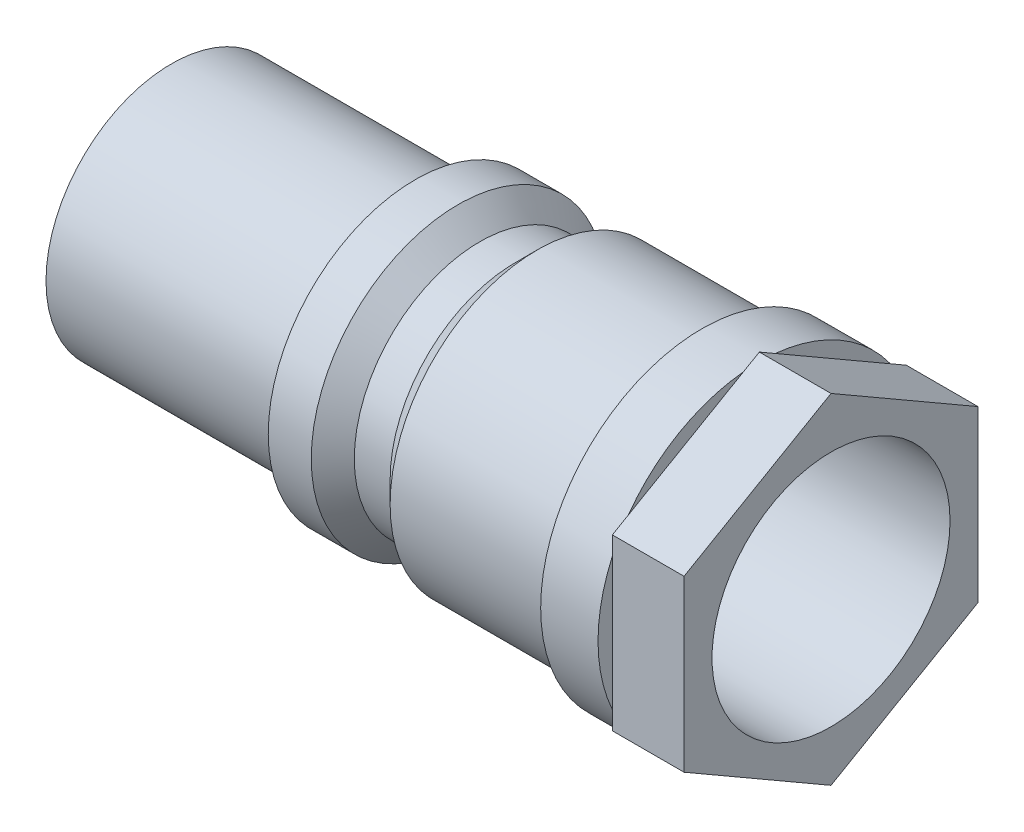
ISO-10303-21;
HEADER;
FILE_DESCRIPTION(('STEP AP214'),'2;1');
FILE_NAME('part.step','',(''),(''),'','','');
FILE_SCHEMA(('AUTOMOTIVE_DESIGN { 1 0 10303 214 1 1 1 1 }'));
ENDSEC;
DATA;
#1=APPLICATION_CONTEXT('core data for automotive mechanical design processes');
#2=APPLICATION_PROTOCOL_DEFINITION('international standard','automotive_design',2000,#1);
#3=PRODUCT_CONTEXT('',#1,'mechanical');
#4=PRODUCT('Part','Part','',(#3));
#5=PRODUCT_RELATED_PRODUCT_CATEGORY('part','',(#4));
#6=PRODUCT_DEFINITION_FORMATION('','',#4);
#7=PRODUCT_DEFINITION_CONTEXT('part definition',#1,'design');
#8=PRODUCT_DEFINITION('design','',#6,#7);
#9=PRODUCT_DEFINITION_SHAPE('','',#8);
#10=(LENGTH_UNIT() NAMED_UNIT(*) SI_UNIT(.MILLI.,.METRE.));
#11=(NAMED_UNIT(*) PLANE_ANGLE_UNIT() SI_UNIT($,.RADIAN.));
#12=(NAMED_UNIT(*) SI_UNIT($,.STERADIAN.) SOLID_ANGLE_UNIT());
#13=UNCERTAINTY_MEASURE_WITH_UNIT(LENGTH_MEASURE(1.E-05),#10,'distance_accuracy_value','');
#14=(GEOMETRIC_REPRESENTATION_CONTEXT(3) GLOBAL_UNCERTAINTY_ASSIGNED_CONTEXT((#13)) GLOBAL_UNIT_ASSIGNED_CONTEXT((#10,
#11,#12)) REPRESENTATION_CONTEXT('',''));
#15=CARTESIAN_POINT('',(0.,0.,0.));
#16=DIRECTION('',(0.,0.,1.));
#17=DIRECTION('',(1.,0.,0.));
#18=AXIS2_PLACEMENT_3D('',#15,#16,#17);
#19=CARTESIAN_POINT('',(82.,22.5,0.));
#20=DIRECTION('',(-1.,0.,0.));
#21=DIRECTION('',(0.,0.,1.));
#22=AXIS2_PLACEMENT_3D('',#19,#20,#21);
#23=PLANE('',#22);
#24=DIRECTION('',(0.,0.5,0.866025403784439));
#25=VECTOR('',#24,1.);
#26=CARTESIAN_POINT('',(82.,11.8356805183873,-20.5));
#27=LINE('',#26,#25);
#28=CARTESIAN_POINT('',(82.,13.1167115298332,-18.2811892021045));
#29=VERTEX_POINT('',#28);
#30=CARTESIAN_POINT('',(82.,22.3903300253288,-2.21881079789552));
#31=VERTEX_POINT('',#30);
#32=EDGE_CURVE('E11',#29,#31,#27,.T.);
#33=ORIENTED_EDGE('',*,*,#32,.F.);
#34=CARTESIAN_POINT('',(82.,0.,0.));
#35=DIRECTION('',(-1.,0.,0.));
#36=DIRECTION('',(0.,0.,1.));
#37=AXIS2_PLACEMENT_3D('',#34,#35,#36);
#38=CIRCLE('',#37,22.5);
#39=EDGE_CURVE('E269',#31,#29,#38,.T.);
#40=ORIENTED_EDGE('',*,*,#39,.F.);
#41=EDGE_LOOP('',(#33,#40));
#42=FACE_BOUND('',#41,.T.);
#43=ADVANCED_FACE('F33',(#42),#23,.F.);
#44=DIRECTION('',(0.,1.,0.));
#45=VECTOR('',#44,1.);
#46=CARTESIAN_POINT('',(82.,-11.8356805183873,-20.5));
#47=LINE('',#46,#45);
#48=CARTESIAN_POINT('',(82.,-9.2736184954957,-20.5));
#49=VERTEX_POINT('',#48);
#50=CARTESIAN_POINT('',(82.,9.27361849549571,-20.5));
#51=VERTEX_POINT('',#50);
#52=EDGE_CURVE('E42',#49,#51,#47,.T.);
#53=ORIENTED_EDGE('',*,*,#52,.F.);
#54=EDGE_CURVE('E273',#51,#49,#38,.T.);
#55=ORIENTED_EDGE('',*,*,#54,.F.);
#56=EDGE_LOOP('',(#53,#55));
#57=FACE_BOUND('',#56,.T.);
#58=ADVANCED_FACE('F238',(#57),#23,.F.);
#59=DIRECTION('',(0.,0.5,-0.866025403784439));
#60=VECTOR('',#59,1.);
#61=CARTESIAN_POINT('',(82.,-23.6713610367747,0.));
#62=LINE('',#61,#60);
#63=CARTESIAN_POINT('',(82.,-22.3903300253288,-2.21881079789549));
#64=VERTEX_POINT('',#63);
#65=CARTESIAN_POINT('',(82.,-13.1167115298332,-18.2811892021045));
#66=VERTEX_POINT('',#65);
#67=EDGE_CURVE('E307',#64,#66,#62,.T.);
#68=ORIENTED_EDGE('',*,*,#67,.F.);
#69=EDGE_CURVE('E279',#66,#64,#38,.T.);
#70=ORIENTED_EDGE('',*,*,#69,.F.);
#71=EDGE_LOOP('',(#68,#70));
#72=FACE_BOUND('',#71,.T.);
#73=ADVANCED_FACE('F245',(#72),#23,.F.);
#74=DIRECTION('',(0.,-0.5,-0.866025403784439));
#75=VECTOR('',#74,1.);
#76=CARTESIAN_POINT('',(82.,-11.8356805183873,20.5));
#77=LINE('',#76,#75);
#78=CARTESIAN_POINT('',(82.,-13.1167115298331,18.2811892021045));
#79=VERTEX_POINT('',#78);
#80=CARTESIAN_POINT('',(82.,-22.3903300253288,2.21881079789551));
#81=VERTEX_POINT('',#80);
#82=EDGE_CURVE('E58',#79,#81,#77,.T.);
#83=ORIENTED_EDGE('',*,*,#82,.F.);
#84=EDGE_CURVE('E285',#81,#79,#38,.T.);
#85=ORIENTED_EDGE('',*,*,#84,.F.);
#86=EDGE_LOOP('',(#83,#85));
#87=FACE_BOUND('',#86,.T.);
#88=ADVANCED_FACE('F257',(#87),#23,.F.);
#89=DIRECTION('',(0.,-1.,0.));
#90=VECTOR('',#89,1.);
#91=CARTESIAN_POINT('',(82.,11.8356805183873,20.5));
#92=LINE('',#91,#90);
#93=CARTESIAN_POINT('',(82.,9.27361849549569,20.5));
#94=VERTEX_POINT('',#93);
#95=CARTESIAN_POINT('',(82.,-9.27361849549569,20.5));
#96=VERTEX_POINT('',#95);
#97=EDGE_CURVE('E190',#94,#96,#92,.T.);
#98=ORIENTED_EDGE('',*,*,#97,.F.);
#99=EDGE_CURVE('E51',#96,#94,#38,.T.);
#100=ORIENTED_EDGE('',*,*,#99,.F.);
#101=EDGE_LOOP('',(#98,#100));
#102=FACE_BOUND('',#101,.T.);
#103=ADVANCED_FACE('F250',(#102),#23,.F.);
#104=DIRECTION('',(0.,-0.5,0.866025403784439));
#105=VECTOR('',#104,1.);
#106=CARTESIAN_POINT('',(82.,23.6713610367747,0.));
#107=LINE('',#106,#105);
#108=CARTESIAN_POINT('',(82.,22.3903300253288,2.21881079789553));
#109=VERTEX_POINT('',#108);
#110=CARTESIAN_POINT('',(82.,13.1167115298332,18.2811892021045));
#111=VERTEX_POINT('',#110);
#112=EDGE_CURVE('E186',#109,#111,#107,.T.);
#113=ORIENTED_EDGE('',*,*,#112,.F.);
#114=EDGE_CURVE('E161',#111,#109,#38,.T.);
#115=ORIENTED_EDGE('',*,*,#114,.F.);
#116=EDGE_LOOP('',(#113,#115));
#117=FACE_BOUND('',#116,.T.);
#118=ADVANCED_FACE('F241',(#117),#23,.F.);
#119=CARTESIAN_POINT('',(0.,0.,0.));
#120=DIRECTION('',(1.,0.,0.));
#121=DIRECTION('',(0.,0.,-1.));
#122=AXIS2_PLACEMENT_3D('',#119,#120,#121);
#123=PLANE('',#122);
#124=CARTESIAN_POINT('',(0.,0.,0.));
#125=DIRECTION('',(1.,0.,0.));
#126=DIRECTION('',(0.,0.,-1.));
#127=AXIS2_PLACEMENT_3D('',#124,#125,#126);
#128=CIRCLE('',#127,16.6);
#129=CARTESIAN_POINT('',(0.,0.,-16.6));
#130=VERTEX_POINT('',#129);
#131=EDGE_CURVE('E200',#130,#130,#128,.T.);
#132=ORIENTED_EDGE('',*,*,#131,.T.);
#133=EDGE_LOOP('',(#132));
#134=FACE_BOUND('',#133,.T.);
#135=CARTESIAN_POINT('',(0.,0.,0.));
#136=DIRECTION('',(-1.,0.,0.));
#137=DIRECTION('',(0.,0.,1.));
#138=AXIS2_PLACEMENT_3D('',#135,#136,#137);
#139=CIRCLE('',#138,17.5);
#140=CARTESIAN_POINT('',(0.,0.,17.5));
#141=VERTEX_POINT('',#140);
#142=EDGE_CURVE('E37',#141,#141,#139,.T.);
#143=ORIENTED_EDGE('',*,*,#142,.T.);
#144=EDGE_LOOP('',(#143));
#145=FACE_BOUND('',#144,.T.);
#146=ADVANCED_FACE('F35',(#134,#145),#123,.F.);
#147=CARTESIAN_POINT('',(0.,0.,0.));
#148=DIRECTION('',(-1.,0.,0.));
#149=DIRECTION('',(0.,0.,1.));
#150=AXIS2_PLACEMENT_3D('',#147,#148,#149);
#151=CYLINDRICAL_SURFACE('',#150,17.5);
#152=ORIENTED_EDGE('',*,*,#142,.F.);
#153=EDGE_LOOP('',(#152));
#154=FACE_BOUND('',#153,.T.);
#155=CARTESIAN_POINT('',(34.,0.,0.));
#156=DIRECTION('',(-1.,0.,0.));
#157=DIRECTION('',(0.,0.,1.));
#158=AXIS2_PLACEMENT_3D('',#155,#156,#157);
#159=CIRCLE('',#158,17.5);
#160=CARTESIAN_POINT('',(34.,0.,17.5));
#161=VERTEX_POINT('',#160);
#162=EDGE_CURVE('E181',#161,#161,#159,.T.);
#163=ORIENTED_EDGE('',*,*,#162,.T.);
#164=EDGE_LOOP('',(#163));
#165=FACE_BOUND('',#164,.T.);
#166=ADVANCED_FACE('F256',(#154,#165),#151,.T.);
#167=CARTESIAN_POINT('',(34.,17.5,0.));
#168=DIRECTION('',(1.,0.,0.));
#169=DIRECTION('',(0.,0.,-1.));
#170=AXIS2_PLACEMENT_3D('',#167,#168,#169);
#171=PLANE('',#170);
#172=ORIENTED_EDGE('',*,*,#162,.F.);
#173=EDGE_LOOP('',(#172));
#174=FACE_BOUND('',#173,.T.);
#175=CARTESIAN_POINT('',(34.,0.,0.));
#176=DIRECTION('',(-1.,0.,0.));
#177=DIRECTION('',(0.,0.,1.));
#178=AXIS2_PLACEMENT_3D('',#175,#176,#177);
#179=CIRCLE('',#178,20.5);
#180=CARTESIAN_POINT('',(34.,0.,20.5));
#181=VERTEX_POINT('',#180);
#182=EDGE_CURVE('E179',#181,#181,#179,.T.);
#183=ORIENTED_EDGE('',*,*,#182,.T.);
#184=EDGE_LOOP('',(#183));
#185=FACE_BOUND('',#184,.T.);
#186=ADVANCED_FACE('F470',(#174,#185),#171,.F.);
#187=CARTESIAN_POINT('',(0.,0.,0.));
#188=DIRECTION('',(-1.,0.,0.));
#189=DIRECTION('',(0.,0.,1.));
#190=AXIS2_PLACEMENT_3D('',#187,#188,#189);
#191=CYLINDRICAL_SURFACE('',#190,20.5);
#192=ORIENTED_EDGE('',*,*,#182,.F.);
#193=EDGE_LOOP('',(#192));
#194=FACE_BOUND('',#193,.T.);
#195=CARTESIAN_POINT('',(40.,0.,0.));
#196=DIRECTION('',(-1.,0.,0.));
#197=DIRECTION('',(0.,0.,1.));
#198=AXIS2_PLACEMENT_3D('',#195,#196,#197);
#199=CIRCLE('',#198,20.5);
#200=CARTESIAN_POINT('',(40.,0.,20.5));
#201=VERTEX_POINT('',#200);
#202=EDGE_CURVE('E176',#201,#201,#199,.T.);
#203=ORIENTED_EDGE('',*,*,#202,.T.);
#204=EDGE_LOOP('',(#203));
#205=FACE_BOUND('',#204,.T.);
#206=ADVANCED_FACE('F476',(#194,#205),#191,.T.);
#207=CARTESIAN_POINT('',(43.,0.,0.));
#208=DIRECTION('',(-1.,0.,0.));
#209=DIRECTION('',(0.,0.,1.));
#210=AXIS2_PLACEMENT_3D('',#207,#208,#209);
#211=CONICAL_SURFACE('',#210,17.5,0.78539816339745);
#212=ORIENTED_EDGE('',*,*,#202,.F.);
#213=EDGE_LOOP('',(#212));
#214=FACE_BOUND('',#213,.T.);
#215=CARTESIAN_POINT('',(43.,0.,0.));
#216=DIRECTION('',(-1.,0.,0.));
#217=DIRECTION('',(0.,0.,1.));
#218=AXIS2_PLACEMENT_3D('',#215,#216,#217);
#219=CIRCLE('',#218,17.5);
#220=CARTESIAN_POINT('',(43.,0.,17.5));
#221=VERTEX_POINT('',#220);
#222=EDGE_CURVE('E173',#221,#221,#219,.T.);
#223=ORIENTED_EDGE('',*,*,#222,.T.);
#224=EDGE_LOOP('',(#223));
#225=FACE_BOUND('',#224,.T.);
#226=ADVANCED_FACE('F484',(#214,#225),#211,.T.);
#227=CARTESIAN_POINT('',(0.,0.,0.));
#228=DIRECTION('',(-1.,0.,0.));
#229=DIRECTION('',(0.,0.,1.));
#230=AXIS2_PLACEMENT_3D('',#227,#228,#229);
#231=CYLINDRICAL_SURFACE('',#230,17.5);
#232=ORIENTED_EDGE('',*,*,#222,.F.);
#233=EDGE_LOOP('',(#232));
#234=FACE_BOUND('',#233,.T.);
#235=CARTESIAN_POINT('',(48.,0.,0.));
#236=DIRECTION('',(-1.,0.,0.));
#237=DIRECTION('',(0.,0.,1.));
#238=AXIS2_PLACEMENT_3D('',#235,#236,#237);
#239=CIRCLE('',#238,17.5);
#240=CARTESIAN_POINT('',(48.,0.,17.5));
#241=VERTEX_POINT('',#240);
#242=EDGE_CURVE('E170',#241,#241,#239,.T.);
#243=ORIENTED_EDGE('',*,*,#242,.T.);
#244=EDGE_LOOP('',(#243));
#245=FACE_BOUND('',#244,.T.);
#246=ADVANCED_FACE('F492',(#234,#245),#231,.T.);
#247=CARTESIAN_POINT('',(51.,0.,0.));
#248=DIRECTION('',(1.,0.,0.));
#249=DIRECTION('',(0.,0.,-1.));
#250=AXIS2_PLACEMENT_3D('',#247,#248,#249);
#251=CONICAL_SURFACE('',#250,20.5,0.785398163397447);
#252=ORIENTED_EDGE('',*,*,#242,.F.);
#253=EDGE_LOOP('',(#252));
#254=FACE_BOUND('',#253,.T.);
#255=CARTESIAN_POINT('',(51.,0.,0.));
#256=DIRECTION('',(-1.,0.,0.));
#257=DIRECTION('',(0.,0.,1.));
#258=AXIS2_PLACEMENT_3D('',#255,#256,#257);
#259=CIRCLE('',#258,20.5);
#260=CARTESIAN_POINT('',(51.,0.,20.5));
#261=VERTEX_POINT('',#260);
#262=EDGE_CURVE('E167',#261,#261,#259,.T.);
#263=ORIENTED_EDGE('',*,*,#262,.T.);
#264=EDGE_LOOP('',(#263));
#265=FACE_BOUND('',#264,.T.);
#266=ADVANCED_FACE('F500',(#254,#265),#251,.T.);
#267=CARTESIAN_POINT('',(0.,0.,0.));
#268=DIRECTION('',(-1.,0.,0.));
#269=DIRECTION('',(0.,0.,1.));
#270=AXIS2_PLACEMENT_3D('',#267,#268,#269);
#271=CYLINDRICAL_SURFACE('',#270,20.5);
#272=ORIENTED_EDGE('',*,*,#262,.F.);
#273=EDGE_LOOP('',(#272));
#274=FACE_BOUND('',#273,.T.);
#275=CARTESIAN_POINT('',(74.,0.,0.));
#276=DIRECTION('',(-1.,0.,0.));
#277=DIRECTION('',(0.,0.,1.));
#278=AXIS2_PLACEMENT_3D('',#275,#276,#277);
#279=CIRCLE('',#278,20.5);
#280=CARTESIAN_POINT('',(74.,0.,20.5));
#281=VERTEX_POINT('',#280);
#282=EDGE_CURVE('E164',#281,#281,#279,.T.);
#283=ORIENTED_EDGE('',*,*,#282,.T.);
#284=EDGE_LOOP('',(#283));
#285=FACE_BOUND('',#284,.T.);
#286=ADVANCED_FACE('F508',(#274,#285),#271,.T.);
#287=CARTESIAN_POINT('',(74.,20.5,0.));
#288=DIRECTION('',(1.,0.,0.));
#289=DIRECTION('',(0.,0.,-1.));
#290=AXIS2_PLACEMENT_3D('',#287,#288,#289);
#291=PLANE('',#290);
#292=ORIENTED_EDGE('',*,*,#282,.F.);
#293=EDGE_LOOP('',(#292));
#294=FACE_BOUND('',#293,.T.);
#295=CARTESIAN_POINT('',(74.,0.,0.));
#296=DIRECTION('',(-1.,0.,0.));
#297=DIRECTION('',(0.,0.,1.));
#298=AXIS2_PLACEMENT_3D('',#295,#296,#297);
#299=CIRCLE('',#298,22.5);
#300=CARTESIAN_POINT('',(74.,0.,22.5));
#301=VERTEX_POINT('',#300);
#302=EDGE_CURVE('E160',#301,#301,#299,.T.);
#303=ORIENTED_EDGE('',*,*,#302,.T.);
#304=EDGE_LOOP('',(#303));
#305=FACE_BOUND('',#304,.T.);
#306=ADVANCED_FACE('F353',(#294,#305),#291,.F.);
#307=CARTESIAN_POINT('',(0.,0.,0.));
#308=DIRECTION('',(-1.,0.,0.));
#309=DIRECTION('',(0.,0.,1.));
#310=AXIS2_PLACEMENT_3D('',#307,#308,#309);
#311=CYLINDRICAL_SURFACE('',#310,22.5);
#312=ORIENTED_EDGE('',*,*,#302,.F.);
#313=EDGE_LOOP('',(#312));
#314=FACE_BOUND('',#313,.T.);
#315=EDGE_CURVE('E155',#94,#111,#38,.T.);
#316=ORIENTED_EDGE('',*,*,#315,.T.);
#317=ORIENTED_EDGE('',*,*,#114,.T.);
#318=EDGE_CURVE('E265',#109,#31,#38,.T.);
#319=ORIENTED_EDGE('',*,*,#318,.T.);
#320=ORIENTED_EDGE('',*,*,#39,.T.);
#321=EDGE_CURVE('E270',#29,#51,#38,.T.);
#322=ORIENTED_EDGE('',*,*,#321,.T.);
#323=ORIENTED_EDGE('',*,*,#54,.T.);
#324=EDGE_CURVE('E276',#49,#66,#38,.T.);
#325=ORIENTED_EDGE('',*,*,#324,.T.);
#326=ORIENTED_EDGE('',*,*,#69,.T.);
#327=EDGE_CURVE('E282',#64,#81,#38,.T.);
#328=ORIENTED_EDGE('',*,*,#327,.T.);
#329=ORIENTED_EDGE('',*,*,#84,.T.);
#330=EDGE_CURVE('E153',#79,#96,#38,.T.);
#331=ORIENTED_EDGE('',*,*,#330,.T.);
#332=ORIENTED_EDGE('',*,*,#99,.T.);
#333=EDGE_LOOP('',(#316,#317,#319,#320,#322,#323,#325,#326,#328,#329,#331,#332));
#334=FACE_BOUND('',#333,.T.);
#335=ADVANCED_FACE('F263',(#314,#334),#311,.T.);
#336=CARTESIAN_POINT('',(82.,0.,0.));
#337=DIRECTION('',(1.,0.,0.));
#338=DIRECTION('',(0.,0.,-1.));
#339=AXIS2_PLACEMENT_3D('',#336,#337,#338);
#340=PLANE('',#339);
#341=ORIENTED_EDGE('',*,*,#315,.F.);
#342=CARTESIAN_POINT('',(82.,11.8356805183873,20.5));
#343=VERTEX_POINT('',#342);
#344=EDGE_CURVE('E196',#343,#94,#92,.T.);
#345=ORIENTED_EDGE('',*,*,#344,.F.);
#346=EDGE_CURVE('E193',#111,#343,#107,.T.);
#347=ORIENTED_EDGE('',*,*,#346,.F.);
#348=EDGE_LOOP('',(#341,#345,#347));
#349=FACE_BOUND('',#348,.T.);
#350=ADVANCED_FACE('F232',(#349),#340,.F.);
#351=ORIENTED_EDGE('',*,*,#318,.F.);
#352=CARTESIAN_POINT('',(82.,23.6713610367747,0.));
#353=VERTEX_POINT('',#352);
#354=EDGE_CURVE('E192',#353,#109,#107,.T.);
#355=ORIENTED_EDGE('',*,*,#354,.F.);
#356=EDGE_CURVE('E45',#31,#353,#27,.T.);
#357=ORIENTED_EDGE('',*,*,#356,.F.);
#358=EDGE_LOOP('',(#351,#355,#357));
#359=FACE_BOUND('',#358,.T.);
#360=ADVANCED_FACE('F268',(#359),#340,.F.);
#361=ORIENTED_EDGE('',*,*,#321,.F.);
#362=CARTESIAN_POINT('',(82.,11.8356805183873,-20.5));
#363=VERTEX_POINT('',#362);
#364=EDGE_CURVE('E44',#363,#29,#27,.T.);
#365=ORIENTED_EDGE('',*,*,#364,.F.);
#366=EDGE_CURVE('E306',#51,#363,#47,.T.);
#367=ORIENTED_EDGE('',*,*,#366,.F.);
#368=EDGE_LOOP('',(#361,#365,#367));
#369=FACE_BOUND('',#368,.T.);
#370=ADVANCED_FACE('F328',(#369),#340,.F.);
#371=ORIENTED_EDGE('',*,*,#324,.F.);
#372=CARTESIAN_POINT('',(82.,-11.8356805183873,-20.5));
#373=VERTEX_POINT('',#372);
#374=EDGE_CURVE('E146',#373,#49,#47,.T.);
#375=ORIENTED_EDGE('',*,*,#374,.F.);
#376=EDGE_CURVE('E302',#66,#373,#62,.T.);
#377=ORIENTED_EDGE('',*,*,#376,.F.);
#378=EDGE_LOOP('',(#371,#375,#377));
#379=FACE_BOUND('',#378,.T.);
#380=ADVANCED_FACE('F379',(#379),#340,.F.);
#381=ORIENTED_EDGE('',*,*,#327,.F.);
#382=CARTESIAN_POINT('',(82.,-23.6713610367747,0.));
#383=VERTEX_POINT('',#382);
#384=EDGE_CURVE('E303',#383,#64,#62,.T.);
#385=ORIENTED_EDGE('',*,*,#384,.F.);
#386=EDGE_CURVE('E299',#81,#383,#77,.T.);
#387=ORIENTED_EDGE('',*,*,#386,.F.);
#388=EDGE_LOOP('',(#381,#385,#387));
#389=FACE_BOUND('',#388,.T.);
#390=ADVANCED_FACE('F233',(#389),#340,.F.);
#391=CARTESIAN_POINT('',(92.,11.8356805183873,-20.5));
#392=DIRECTION('',(0.,-0.866025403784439,0.5));
#393=DIRECTION('',(0.,-0.5,-0.866025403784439));
#394=AXIS2_PLACEMENT_3D('',#391,#392,#393);
#395=PLANE('',#394);
#396=ORIENTED_EDGE('',*,*,#364,.T.);
#397=ORIENTED_EDGE('',*,*,#32,.T.);
#398=ORIENTED_EDGE('',*,*,#356,.T.);
#399=DIRECTION('',(-1.,0.,0.));
#400=VECTOR('',#399,1.);
#401=CARTESIAN_POINT('',(92.,23.6713610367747,0.));
#402=LINE('',#401,#400);
#403=CARTESIAN_POINT('',(92.,23.6713610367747,0.));
#404=VERTEX_POINT('',#403);
#405=EDGE_CURVE('E131',#404,#353,#402,.T.);
#406=ORIENTED_EDGE('',*,*,#405,.F.);
#407=DIRECTION('',(0.,0.5,0.866025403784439));
#408=VECTOR('',#407,1.);
#409=CARTESIAN_POINT('',(92.,11.8356805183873,-20.5));
#410=LINE('',#409,#408);
#411=CARTESIAN_POINT('',(92.,11.8356805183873,-20.5));
#412=VERTEX_POINT('',#411);
#413=EDGE_CURVE('E137',#412,#404,#410,.T.);
#414=ORIENTED_EDGE('',*,*,#413,.F.);
#415=DIRECTION('',(-1.,0.,0.));
#416=VECTOR('',#415,1.);
#417=CARTESIAN_POINT('',(92.,11.8356805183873,-20.5));
#418=LINE('',#417,#416);
#419=EDGE_CURVE('E203',#412,#363,#418,.T.);
#420=ORIENTED_EDGE('',*,*,#419,.T.);
#421=EDGE_LOOP('',(#396,#397,#398,#406,#414,#420));
#422=FACE_BOUND('',#421,.T.);
#423=ADVANCED_FACE('F149',(#422),#395,.F.);
#424=CARTESIAN_POINT('',(92.,23.6713610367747,0.));
#425=DIRECTION('',(0.,-0.866025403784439,-0.5));
#426=DIRECTION('',(0.,0.5,-0.866025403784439));
#427=AXIS2_PLACEMENT_3D('',#424,#425,#426);
#428=PLANE('',#427);
#429=ORIENTED_EDGE('',*,*,#354,.T.);
#430=ORIENTED_EDGE('',*,*,#112,.T.);
#431=ORIENTED_EDGE('',*,*,#346,.T.);
#432=DIRECTION('',(-1.,0.,0.));
#433=VECTOR('',#432,1.);
#434=CARTESIAN_POINT('',(92.,11.8356805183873,20.5));
#435=LINE('',#434,#433);
#436=CARTESIAN_POINT('',(92.,11.8356805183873,20.5));
#437=VERTEX_POINT('',#436);
#438=EDGE_CURVE('E133',#437,#343,#435,.T.);
#439=ORIENTED_EDGE('',*,*,#438,.F.);
#440=DIRECTION('',(0.,-0.5,0.866025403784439));
#441=VECTOR('',#440,1.);
#442=CARTESIAN_POINT('',(92.,23.6713610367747,0.));
#443=LINE('',#442,#441);
#444=EDGE_CURVE('E126',#404,#437,#443,.T.);
#445=ORIENTED_EDGE('',*,*,#444,.F.);
#446=ORIENTED_EDGE('',*,*,#405,.T.);
#447=EDGE_LOOP('',(#429,#430,#431,#439,#445,#446));
#448=FACE_BOUND('',#447,.T.);
#449=ADVANCED_FACE('F129',(#448),#428,.F.);
#450=CARTESIAN_POINT('',(92.,11.8356805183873,20.5));
#451=DIRECTION('',(0.,0.,-1.));
#452=DIRECTION('',(-1.,0.,0.));
#453=AXIS2_PLACEMENT_3D('',#450,#451,#452);
#454=PLANE('',#453);
#455=ORIENTED_EDGE('',*,*,#344,.T.);
#456=ORIENTED_EDGE('',*,*,#97,.T.);
#457=CARTESIAN_POINT('',(82.,-11.8356805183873,20.5));
#458=VERTEX_POINT('',#457);
#459=EDGE_CURVE('E197',#96,#458,#92,.T.);
#460=ORIENTED_EDGE('',*,*,#459,.T.);
#461=DIRECTION('',(-1.,0.,0.));
#462=VECTOR('',#461,1.);
#463=CARTESIAN_POINT('',(92.,-11.8356805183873,20.5));
#464=LINE('',#463,#462);
#465=CARTESIAN_POINT('',(92.,-11.8356805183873,20.5));
#466=VERTEX_POINT('',#465);
#467=EDGE_CURVE('E156',#466,#458,#464,.T.);
#468=ORIENTED_EDGE('',*,*,#467,.F.);
#469=DIRECTION('',(0.,-1.,0.));
#470=VECTOR('',#469,1.);
#471=CARTESIAN_POINT('',(92.,11.8356805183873,20.5));
#472=LINE('',#471,#470);
#473=EDGE_CURVE('E136',#437,#466,#472,.T.);
#474=ORIENTED_EDGE('',*,*,#473,.F.);
#475=ORIENTED_EDGE('',*,*,#438,.T.);
#476=EDGE_LOOP('',(#455,#456,#460,#468,#474,#475));
#477=FACE_BOUND('',#476,.T.);
#478=ADVANCED_FACE('F296',(#477),#454,.F.);
#479=CARTESIAN_POINT('',(92.,-11.8356805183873,20.5));
#480=DIRECTION('',(0.,0.866025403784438,-0.5));
#481=DIRECTION('',(0.,0.5,0.866025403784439));
#482=AXIS2_PLACEMENT_3D('',#479,#480,#481);
#483=PLANE('',#482);
#484=EDGE_CURVE('E291',#458,#79,#77,.T.);
#485=ORIENTED_EDGE('',*,*,#484,.T.);
#486=ORIENTED_EDGE('',*,*,#82,.T.);
#487=ORIENTED_EDGE('',*,*,#386,.T.);
#488=DIRECTION('',(-1.,0.,0.));
#489=VECTOR('',#488,1.);
#490=CARTESIAN_POINT('',(92.,-23.6713610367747,0.));
#491=LINE('',#490,#489);
#492=CARTESIAN_POINT('',(92.,-23.6713610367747,0.));
#493=VERTEX_POINT('',#492);
#494=EDGE_CURVE('E314',#493,#383,#491,.T.);
#495=ORIENTED_EDGE('',*,*,#494,.F.);
#496=DIRECTION('',(0.,-0.5,-0.866025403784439));
#497=VECTOR('',#496,1.);
#498=CARTESIAN_POINT('',(92.,-11.8356805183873,20.5));
#499=LINE('',#498,#497);
#500=EDGE_CURVE('E206',#466,#493,#499,.T.);
#501=ORIENTED_EDGE('',*,*,#500,.F.);
#502=ORIENTED_EDGE('',*,*,#467,.T.);
#503=EDGE_LOOP('',(#485,#486,#487,#495,#501,#502));
#504=FACE_BOUND('',#503,.T.);
#505=ADVANCED_FACE('F318',(#504),#483,.F.);
#506=CARTESIAN_POINT('',(92.,-23.6713610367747,0.));
#507=DIRECTION('',(0.,0.866025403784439,0.5));
#508=DIRECTION('',(0.,-0.5,0.866025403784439));
#509=AXIS2_PLACEMENT_3D('',#506,#507,#508);
#510=PLANE('',#509);
#511=ORIENTED_EDGE('',*,*,#384,.T.);
#512=ORIENTED_EDGE('',*,*,#67,.T.);
#513=ORIENTED_EDGE('',*,*,#376,.T.);
#514=DIRECTION('',(-1.,0.,0.));
#515=VECTOR('',#514,1.);
#516=CARTESIAN_POINT('',(92.,-11.8356805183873,-20.5));
#517=LINE('',#516,#515);
#518=CARTESIAN_POINT('',(92.,-11.8356805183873,-20.5));
#519=VERTEX_POINT('',#518);
#520=EDGE_CURVE('E311',#519,#373,#517,.T.);
#521=ORIENTED_EDGE('',*,*,#520,.F.);
#522=DIRECTION('',(0.,0.5,-0.866025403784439));
#523=VECTOR('',#522,1.);
#524=CARTESIAN_POINT('',(92.,-23.6713610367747,0.));
#525=LINE('',#524,#523);
#526=EDGE_CURVE('E204',#493,#519,#525,.T.);
#527=ORIENTED_EDGE('',*,*,#526,.F.);
#528=ORIENTED_EDGE('',*,*,#494,.T.);
#529=EDGE_LOOP('',(#511,#512,#513,#521,#527,#528));
#530=FACE_BOUND('',#529,.T.);
#531=ADVANCED_FACE('F234',(#530),#510,.F.);
#532=CARTESIAN_POINT('',(92.,-11.8356805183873,-20.5));
#533=DIRECTION('',(0.,0.,1.));
#534=DIRECTION('',(0.,-1.,0.));
#535=AXIS2_PLACEMENT_3D('',#532,#533,#534);
#536=PLANE('',#535);
#537=ORIENTED_EDGE('',*,*,#374,.T.);
#538=ORIENTED_EDGE('',*,*,#52,.T.);
#539=ORIENTED_EDGE('',*,*,#366,.T.);
#540=ORIENTED_EDGE('',*,*,#419,.F.);
#541=DIRECTION('',(0.,1.,0.));
#542=VECTOR('',#541,1.);
#543=CARTESIAN_POINT('',(92.,-11.8356805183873,-20.5));
#544=LINE('',#543,#542);
#545=EDGE_CURVE('E142',#519,#412,#544,.T.);
#546=ORIENTED_EDGE('',*,*,#545,.F.);
#547=ORIENTED_EDGE('',*,*,#520,.T.);
#548=EDGE_LOOP('',(#537,#538,#539,#540,#546,#547));
#549=FACE_BOUND('',#548,.T.);
#550=ADVANCED_FACE('F224',(#549),#536,.F.);
#551=CARTESIAN_POINT('',(92.,0.,0.));
#552=DIRECTION('',(1.,0.,0.));
#553=DIRECTION('',(0.,0.,-1.));
#554=AXIS2_PLACEMENT_3D('',#551,#552,#553);
#555=PLANE('',#554);
#556=CARTESIAN_POINT('',(92.,0.,0.));
#557=DIRECTION('',(1.,0.,0.));
#558=DIRECTION('',(0.,0.,-1.));
#559=AXIS2_PLACEMENT_3D('',#556,#557,#558);
#560=CIRCLE('',#559,16.6);
#561=CARTESIAN_POINT('',(92.,0.,-16.6));
#562=VERTEX_POINT('',#561);
#563=EDGE_CURVE('E209',#562,#562,#560,.T.);
#564=ORIENTED_EDGE('',*,*,#563,.F.);
#565=EDGE_LOOP('',(#564));
#566=FACE_BOUND('',#565,.T.);
#567=ORIENTED_EDGE('',*,*,#413,.T.);
#568=ORIENTED_EDGE('',*,*,#444,.T.);
#569=ORIENTED_EDGE('',*,*,#473,.T.);
#570=ORIENTED_EDGE('',*,*,#500,.T.);
#571=ORIENTED_EDGE('',*,*,#526,.T.);
#572=ORIENTED_EDGE('',*,*,#545,.T.);
#573=EDGE_LOOP('',(#567,#568,#569,#570,#571,#572));
#574=FACE_BOUND('',#573,.T.);
#575=ADVANCED_FACE('F140',(#566,#574),#555,.T.);
#576=ORIENTED_EDGE('',*,*,#330,.F.);
#577=ORIENTED_EDGE('',*,*,#484,.F.);
#578=ORIENTED_EDGE('',*,*,#459,.F.);
#579=EDGE_LOOP('',(#576,#577,#578));
#580=FACE_BOUND('',#579,.T.);
#581=ADVANCED_FACE('F219',(#580),#340,.F.);
#582=CARTESIAN_POINT('',(0.,0.,0.));
#583=DIRECTION('',(1.,0.,0.));
#584=DIRECTION('',(0.,0.,-1.));
#585=AXIS2_PLACEMENT_3D('',#582,#583,#584);
#586=CYLINDRICAL_SURFACE('',#585,16.6);
#587=ORIENTED_EDGE('',*,*,#131,.F.);
#588=EDGE_LOOP('',(#587));
#589=FACE_BOUND('',#588,.T.);
#590=ORIENTED_EDGE('',*,*,#563,.T.);
#591=EDGE_LOOP('',(#590));
#592=FACE_BOUND('',#591,.T.);
#593=ADVANCED_FACE('F216',(#589,#592),#586,.F.);
#594=CLOSED_SHELL('',(#43,#58,#73,#88,#103,#118,#146,#166,#186,#206,#226,#246,#266,#286,#306,
#335,#350,#360,#370,#380,#390,#423,#449,#478,#505,#531,#550,#575,#581,#593));
#595=MANIFOLD_SOLID_BREP('B2',#594);
#596=ADVANCED_BREP_SHAPE_REPRESENTATION('',(#18,#595),#14);
#597=SHAPE_DEFINITION_REPRESENTATION(#9,#596);
ENDSEC;
END-ISO-10303-21;
